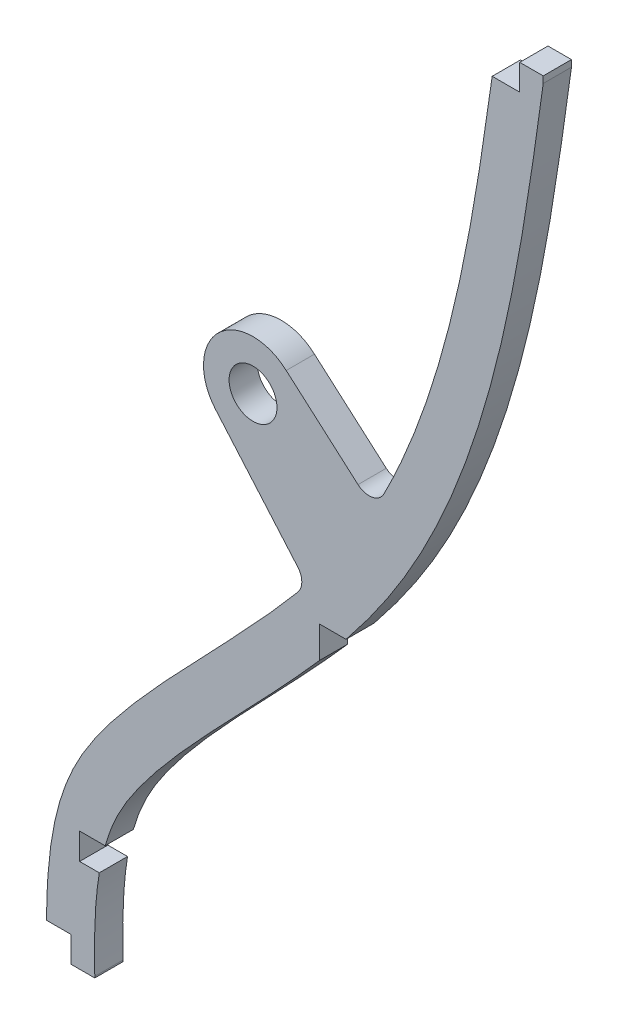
from build123d import *

# Parameters (mm, degrees)
BOSS_EXTRUDE1_DEPTH = 2.9972
SKETCH3_W           = 2.828248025
SKETCH3_H           = 3.360453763
SKETCH3_W_2         = 2.921266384
SKETCH3_H_2         = 2.7432
CUT_EXTRUDE1_DEPTH  = 2.9972
SKETCH4_R           = 2.54
BOSS_EXTRUDE2_DEPTH = 2.9972
FILLET2_R           = 1.778


with BuildPart() as part:
    # Sketch2 → Boss-Extrude1 (new body)
    with BuildSketch(Plane.XY):
        with BuildLine():
            Line((-71.122282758, 0.152274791), (-71.122282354, 0))
            Line((-71.122282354, 0), (-76.2, 0))
            add(Edge.make_bspline(
                [(-76.2, 0), (-76.569654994, 12.326423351), (-70.425353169, 26.763478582), (-35.694986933, 54.959288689), (-31.122332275, 88.312292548), (-28.575, 106.68)],
                knots=[0, 0, 0, 0, 0.192928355, 0.526146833, 1, 1, 1, 1], degree=3))
            Line((-28.575, 106.68), (-23.543159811, 106.68))
            Line((-23.543159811, 106.68), (-23.543159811, 105.98215739))
            add(Edge.make_bspline(
                [(-71.122282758, 0.152274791), (-71.136070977, 0.612053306), (-71.156705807, 1.549793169), (-71.164598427, 3.28211812), (-71.116797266, 5.286174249), (-70.973071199, 7.421615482), (-70.676706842, 9.95097976), (-70.130555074, 12.571826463), (-69.245381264, 15.104636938), (-68.120237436, 17.334393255), (-66.672184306, 19.551075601), (-64.863064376, 21.934930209), (-62.11843264, 25.208242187), (-58.137191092, 29.502846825), (-52.85973139, 34.964227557), (-47.448209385, 40.791541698), (-42.251514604, 47.060450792), (-37.691832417, 53.925317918), (-34.064233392, 61.084345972), (-31.169794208, 68.465794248), (-28.900123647, 75.982476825), (-27.122712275, 83.563137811), (-25.715420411, 91.141122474), (-24.75221092, 97.394015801), (-24.048588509, 102.335722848), (-23.712246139, 104.76294926), (-23.543159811, 105.98215739)],
                knots=[0, 0, 0, 0, 0.0078125, 0.015625, 0.03125, 0.046875, 0.0625, 0.09375, 0.125, 0.15625, 0.1875, 0.21875, 0.25, 0.3125, 0.375, 0.4375, 0.5, 0.5625, 0.625, 0.6875, 0.75, 0.8125, 0.875, 0.9375, 0.96875, 1, 1, 1, 1], degree=3))
        make_face()
    extrude(amount=BOSS_EXTRUDE1_DEPTH)

    # Sketch3 → Cut-Extrude1 (cut)
    with BuildSketch(Plane.XY.offset(2.9972)):
        Polygon((-73.66, 0), (-73.66, 2.7432), (-76.239147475, 2.7432), (-76.567195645, 0), align=None)
        Polygon((-70.028476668, 12.7), (-72.729966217, 12.7), (-72.729966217, 9.906), (-70.643031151, 9.906), align=None)
        with Locations((-45.87350761, 42.769773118)):
            Rectangle(SKETCH3_W, SKETCH3_H)
        with Locations((-27.495633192, 105.3084)):
            Rectangle(SKETCH3_W_2, SKETCH3_H_2)
    extrude(amount=-CUT_EXTRUDE1_DEPTH, mode=Mode.SUBTRACT)

    # Sketch4 → Boss-Extrude2 (add)
    with BuildSketch(Plane.XY.offset(2.9972)):
        with BuildLine():
            Line((-58.336130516, 58.681288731), (-47.446006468, 46.053291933))
            Line((-47.446006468, 46.053291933), (-39.030945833, 55.653227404))
            Line((-39.030945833, 55.653227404), (-50.808604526, 65.977225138))
            ThreePointArc((-50.808604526, 65.977225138), (-57.98767719, 65.852976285), (-58.336130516, 58.681288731))
        make_face()
        with Locations((-54.331784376, 62.081037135)):
            Circle(SKETCH4_R, mode=Mode.SUBTRACT)
    extrude(amount=-BOSS_EXTRUDE2_DEPTH)

    # Fillet2
    fillet2_edges = [part.edges().sort_by_distance(p)[0] for p in [
        (-48.608915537, 47.401780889, 1.4986),
        (-41.504870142, 57.821806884, 1.4986),
    ]]
    fillet(fillet2_edges, radius=FILLET2_R)


solid = part.part
